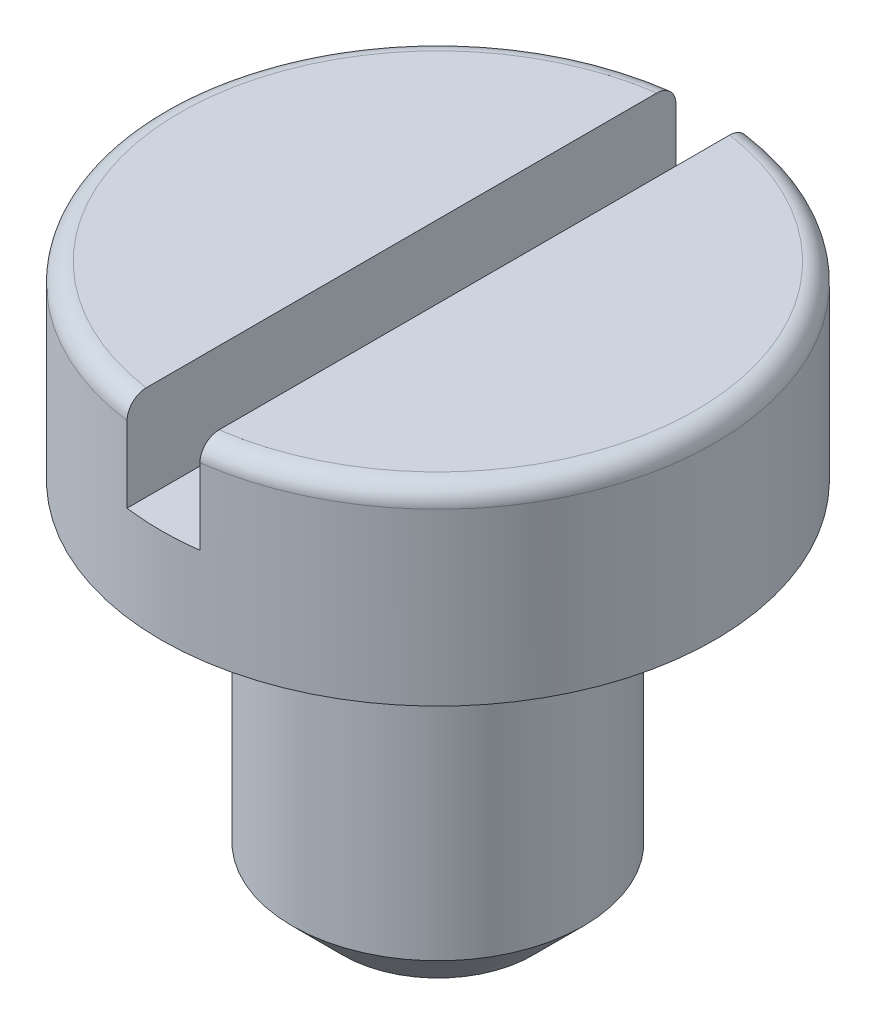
from build123d import *

# Parameters (mm, degrees)
ESQUISSE1_R             = 1
BASE_EXTRUSION_DEPTH    = 2.5
CHANFREIN1_SIZE         = 0.35
ESQUISSE3_W             = 0.5
ESQUISSE3_H             = 3.8
ENL_V_MAT_EXTRU_1_DEPTH = 0.65


with BuildPart() as part:
    # Esquisse1 → Base-Extrusion (new body)
    with BuildSketch(Plane(origin=(0, 0, 0), x_dir=(1, 0, 0), z_dir=(0, 1, 0))):
        with Locations(Location((0, 0, 0), (0, 0, 270))):
            Circle(ESQUISSE1_R)
    extrude(amount=-BASE_EXTRUSION_DEPTH)

    # Chanfrein1
    chanfrein1_edges = [part.edges().sort_by_distance(p)[0] for p in [
        (0, -2.5, -1),
    ]]
    chamfer(chanfrein1_edges, length=CHANFREIN1_SIZE)

    # Esquisse2 → Boss.-R_vol.1 (revolve)
    with BuildSketch(Plane.XY, mode=Mode.PRIVATE) as boss_r_vol_1_sk:
        with BuildLine():
            Line((0, 1.3), (0, 0))
            Line((0, 0), (1.9, 0))
            Line((1.9, 0), (1.9, 1.17))
            ThreePointArc((1.9, 1.17), (1.861923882, 1.261923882), (1.77, 1.3))
            Line((1.77, 1.3), (0, 1.3))
        make_face()
    revolve(boss_r_vol_1_sk.sketch.rotate(Axis((0, 1.3, 0), (0, -1, 0)), 90), axis=Axis((0, 1.3, 0), (0, -1, 0)))

    # Esquisse3 → Enl_v. mat.-Extru.1 (cut)
    with BuildSketch(Plane(origin=(0, 1.3, 0), x_dir=(-1, 0, 0), z_dir=(0, 1, 0))):
        Rectangle(ESQUISSE3_W, ESQUISSE3_H)
    extrude(amount=-ENL_V_MAT_EXTRU_1_DEPTH, mode=Mode.SUBTRACT)


solid = part.part
